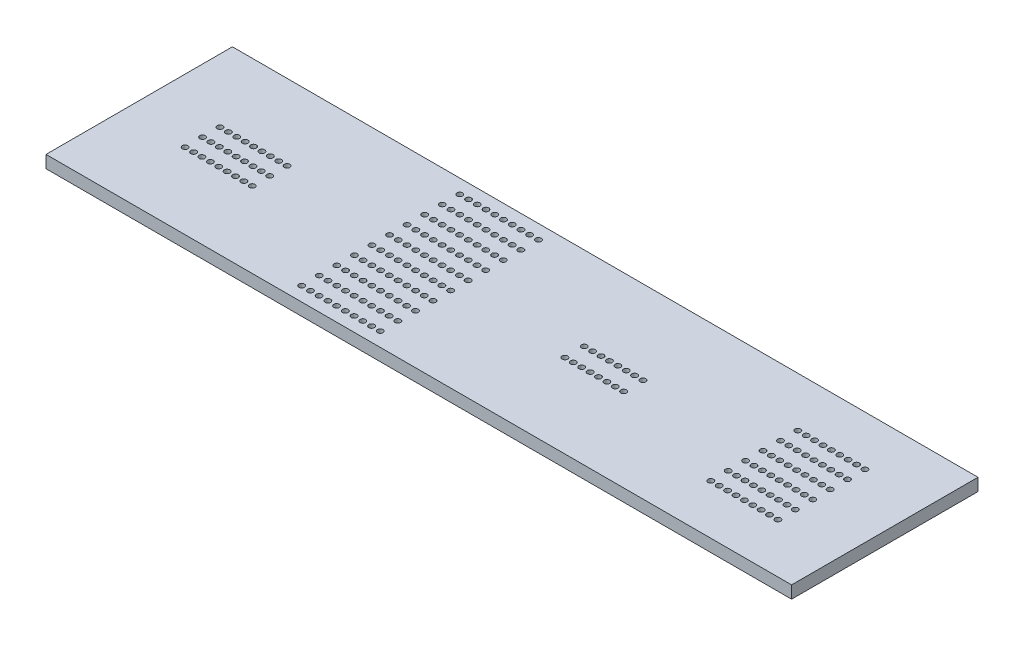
from build123d import *

# Parameters (mm, degrees)
ESQUISSE2_W                     = 120
ESQUISSE2_H                     = 30
BOSS_EXTRU_1_DEPTH              = 2
ENL_V_MAT_EXTRU_3_REACH         = 63.879
ESQUISSE8_R                     = 0.45
R_P_TITION_LIN_AIRE4_COUNT      = 9
R_P_TITION_LIN_AIRE4_PITCH      = 1.35
R_P_TITION_LIN_AIRE4_COUNT_DIR2 = 3
R_P_TITION_LIN_AIRE4_PITCH_DIR2 = 2.8
ENL_V_MAT_EXTRU_4_REACH         = 63.879
ESQUISSE10_R                    = 0.45
R_P_TITION_LIN_AIRE5_COUNT      = 10
R_P_TITION_LIN_AIRE5_PITCH      = 1.406
R_P_TITION_LIN_AIRE5_COUNT_DIR2 = 10
R_P_TITION_LIN_AIRE5_PITCH_DIR2 = 2.827777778
ENL_V_MAT_EXTRU_5_REACH         = 63.879
ESQUISSE12_R                    = 0.45
R_P_TITION_LIN_AIRE6_COUNT      = 8
R_P_TITION_LIN_AIRE6_PITCH      = 1.35
R_P_TITION_LIN_AIRE6_COUNT_DIR2 = 2
R_P_TITION_LIN_AIRE6_PITCH_DIR2 = 3.111
ENL_V_MAT_EXTRU_6_REACH         = 63.879
ESQUISSE14_R                    = 0.45
R_P_TITION_LIN_AIRE7_COUNT      = 9
R_P_TITION_LIN_AIRE7_PITCH      = 1.35
R_P_TITION_LIN_AIRE7_COUNT_DIR2 = 6
R_P_TITION_LIN_AIRE7_PITCH_DIR2 = 2.8


with BuildPart() as part:
    # Esquisse2 → Boss.-Extru.1 (new body)
    with BuildSketch(Plane(origin=(0, 0, 0), x_dir=(1, 0, 0), z_dir=(0, 1, 0))):
        Rectangle(ESQUISSE2_W, ESQUISSE2_H)
    extrude(amount=BOSS_EXTRU_1_DEPTH)

    # Esquisse8 → Enl_v. mat.-Extru.3 (cut, up to next)
    with BuildSketch(Plane(origin=(0, 2, 0), x_dir=(1, 0, 0), z_dir=(0, 1, 0)), mode=Mode.PRIVATE) as enl_v_mat_extru_3_sk1:
        with Locations(Location((-49.8, 2.8, 0), (0, 0, 270))):
            Circle(ESQUISSE8_R)
    enl_v_mat_extru_3_tool1 = extrude(enl_v_mat_extru_3_sk1.sketch, amount=-ENL_V_MAT_EXTRU_3_REACH, mode=Mode.PRIVATE) & part.part
    enl_v_mat_extru_3 = enl_v_mat_extru_3_tool1.solids().sort_by_distance((-49.8, 2, -2.8))[0]
    add(enl_v_mat_extru_3, mode=Mode.SUBTRACT)

    # R_p_tition lin_aire4: Enl_v. mat.-Extru.3 9 × 3
    with Locations(*[(i * R_P_TITION_LIN_AIRE4_PITCH, 0, j * R_P_TITION_LIN_AIRE4_PITCH_DIR2) for i in range(R_P_TITION_LIN_AIRE4_COUNT) for j in range(R_P_TITION_LIN_AIRE4_COUNT_DIR2) if (i, j) != (0, 0)]):
        add(enl_v_mat_extru_3, mode=Mode.SUBTRACT)

    # Esquisse10 → Enl_v. mat.-Extru.4 (cut, up to next)
    with BuildSketch(Plane(origin=(0, 2, 0), x_dir=(1, 0, 0), z_dir=(0, 1, 0)), mode=Mode.PRIVATE) as enl_v_mat_extru_4_sk1:
        with Locations(Location((-21.127, 12.725, 0), (0, 0, 270))):
            Circle(ESQUISSE10_R)
    enl_v_mat_extru_4_tool1 = extrude(enl_v_mat_extru_4_sk1.sketch, amount=-ENL_V_MAT_EXTRU_4_REACH, mode=Mode.PRIVATE) & part.part
    enl_v_mat_extru_4 = enl_v_mat_extru_4_tool1.solids().sort_by_distance((-21.127, 2, -12.725))[0]
    add(enl_v_mat_extru_4, mode=Mode.SUBTRACT)

    # R_p_tition lin_aire5: Enl_v. mat.-Extru.4 10 × 10
    with Locations(*[(i * R_P_TITION_LIN_AIRE5_PITCH, 0, j * R_P_TITION_LIN_AIRE5_PITCH_DIR2) for i in range(R_P_TITION_LIN_AIRE5_COUNT) for j in range(R_P_TITION_LIN_AIRE5_COUNT_DIR2) if (i, j) != (0, 0)]):
        add(enl_v_mat_extru_4, mode=Mode.SUBTRACT)

    # Esquisse12 → Enl_v. mat.-Extru.5 (cut, up to next)
    with BuildSketch(Plane(origin=(0, 2, 0), x_dir=(1, 0, 0), z_dir=(0, 1, 0)), mode=Mode.PRIVATE) as enl_v_mat_extru_5_sk1:
        with Locations(Location((10.075, 1.5555, 0), (0, 0, 270))):
            Circle(ESQUISSE12_R)
    enl_v_mat_extru_5_tool1 = extrude(enl_v_mat_extru_5_sk1.sketch, amount=-ENL_V_MAT_EXTRU_5_REACH, mode=Mode.PRIVATE) & part.part
    enl_v_mat_extru_5 = enl_v_mat_extru_5_tool1.solids().sort_by_distance((10.075, 2, -1.5555))[0]
    add(enl_v_mat_extru_5, mode=Mode.SUBTRACT)

    # R_p_tition lin_aire6: Enl_v. mat.-Extru.5 8 × 2
    with Locations(*[(i * R_P_TITION_LIN_AIRE6_PITCH, 0, j * R_P_TITION_LIN_AIRE6_PITCH_DIR2) for i in range(R_P_TITION_LIN_AIRE6_COUNT) for j in range(R_P_TITION_LIN_AIRE6_COUNT_DIR2) if (i, j) != (0, 0)]):
        add(enl_v_mat_extru_5, mode=Mode.SUBTRACT)

    # Esquisse14 → Enl_v. mat.-Extru.6 (cut, up to next)
    with BuildSketch(Plane(origin=(0, 2, 0), x_dir=(1, 0, 0), z_dir=(0, 1, 0)), mode=Mode.PRIVATE) as enl_v_mat_extru_6_sk1:
        with Locations(Location((39, 7, 0), (0, 0, 270))):
            Circle(ESQUISSE14_R)
    enl_v_mat_extru_6_tool1 = extrude(enl_v_mat_extru_6_sk1.sketch, amount=-ENL_V_MAT_EXTRU_6_REACH, mode=Mode.PRIVATE) & part.part
    enl_v_mat_extru_6 = enl_v_mat_extru_6_tool1.solids().sort_by_distance((39, 2, -7))[0]
    add(enl_v_mat_extru_6, mode=Mode.SUBTRACT)

    # R_p_tition lin_aire7: Enl_v. mat.-Extru.6 9 × 6
    with Locations(*[(i * R_P_TITION_LIN_AIRE7_PITCH, 0, j * R_P_TITION_LIN_AIRE7_PITCH_DIR2) for i in range(R_P_TITION_LIN_AIRE7_COUNT) for j in range(R_P_TITION_LIN_AIRE7_COUNT_DIR2) if (i, j) != (0, 0)]):
        add(enl_v_mat_extru_6, mode=Mode.SUBTRACT)


solid = part.part
